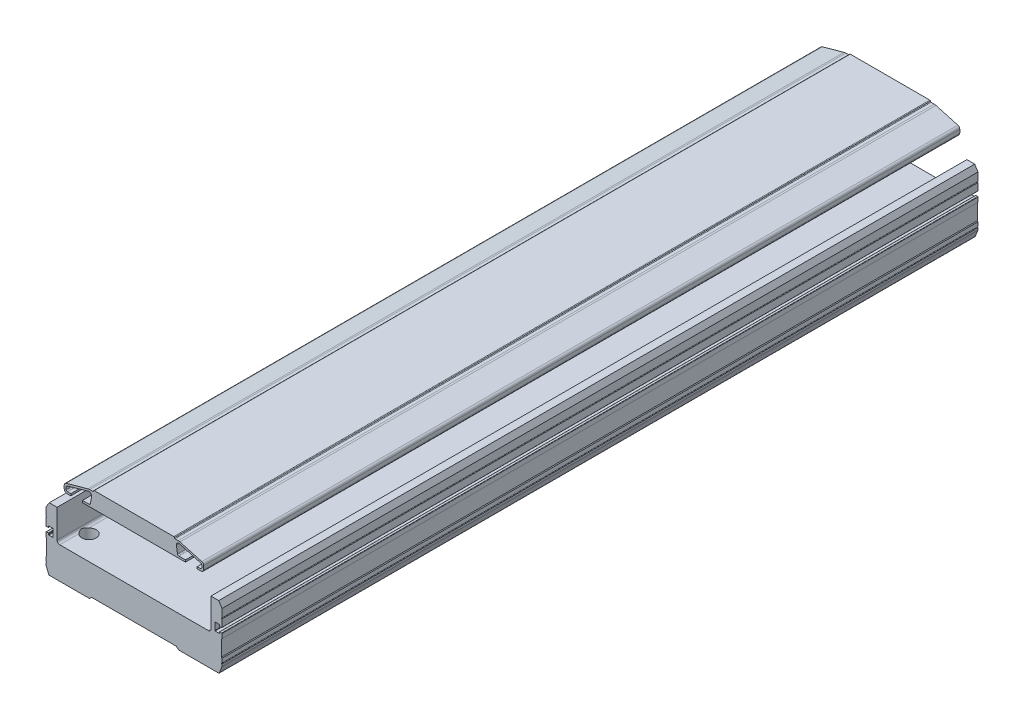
from build123d import *

# Parameters (mm, degrees)
EXTRUDE_1_DEPTH             = 580
EXTRUDE_1_2_DEPTH           = 580
HOLE_WIZARD_1_AT_2_COUNT    = 2
HOLE_WIZARD_1_AT_2_PITCH    = 100
HOLE_WIZARD_1_AT_3_COUNT    = 2
HOLE_WIZARD_1_AT_3_PITCH    = 500
HOLE_WIZARD_1_AT_4_COUNT    = 2
HOLE_WIZARD_1_AT_4_PITCH    = 300
HOLE_WIZARD_1_AT_5_COUNT    = 2
HOLE_WIZARD_1_AT_5_PITCH    = 318.176051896
HOLE_WIZARD_1_AT_6_COUNT    = 2
HOLE_WIZARD_1_AT_6_PITCH    = 511.112512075
HOLE_WIZARD_1_AT_7_COUNT    = 2
HOLE_WIZARD_1_AT_7_PITCH    = 145.725769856
HOLE_WIZARD_1_AT_8_COUNT    = 2
HOLE_WIZARD_1_AT_8_PITCH    = 106
HOLE_WIZARD_M6_1_AT_2_COUNT = 2
HOLE_WIZARD_M6_1_AT_2_PITCH = 106
HOLE_WIZARD_M6_1_AT_3_COUNT = 2
HOLE_WIZARD_M6_1_AT_3_PITCH = 100
HOLE_WIZARD_M6_1_AT_4_COUNT = 2
HOLE_WIZARD_M6_1_AT_4_PITCH = 300
HOLE_WIZARD_M6_1_AT_5_COUNT = 2
HOLE_WIZARD_M6_1_AT_5_PITCH = 500
HOLE_WIZARD_M6_1_AT_6_COUNT = 2
HOLE_WIZARD_M6_1_AT_6_PITCH = 511.112512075
HOLE_WIZARD_M6_1_AT_7_COUNT = 2
HOLE_WIZARD_M6_1_AT_7_PITCH = 318.176051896
HOLE_WIZARD_M6_1_AT_8_COUNT = 2
HOLE_WIZARD_M6_1_AT_8_PITCH = 145.725769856


with BuildPart() as part:
    # Sketch 1 → Extrude 1 (new body)
    with BuildSketch(Plane.XY):
        with BuildLine():
            Line((-51.499999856, 59.400000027), (-48.499999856, 59.400000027))
            Line((-48.499999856, 59.400000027), (-48.499999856, 60.900000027))
            Line((-48.499999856, 60.900000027), (-50.999999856, 60.900000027))
            ThreePointArc((-50.999999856, 60.900000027), (-51.707106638, 61.192893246), (-51.999999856, 61.900000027))
            Line((-51.999999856, 61.900000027), (-51.999999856, 63.704621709))
            ThreePointArc((-51.999999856, 63.704621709), (-51.796871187, 64.308770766), (-51.27000769, 64.667479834))
            Line((-51.27000769, 64.667479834), (-35.04852954, 69.21635995))
            ThreePointArc((-35.04852954, 69.21635995), (-33.17193273, 68.778444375), (-32.536146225, 66.959334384))
            Line((-32.536146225, 66.959334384), (-33.413816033, 61.73434537))
            ThreePointArc((-33.413816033, 61.73434537), (-33.754110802, 61.136568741), (-34.399999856, 60.900000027))
            Line((-34.399999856, 60.900000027), (-39.499999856, 60.900000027))
            Line((-39.499999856, 60.900000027), (-39.499999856, 59.400000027))
            Line((-39.499999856, 59.400000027), (39.500000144, 59.400000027))
            Line((39.500000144, 59.400000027), (39.500000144, 60.900000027))
            Line((39.500000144, 60.900000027), (34.400000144, 60.900000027))
            ThreePointArc((34.400000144, 60.900000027), (33.754111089, 61.136568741), (33.41381632, 61.73434537))
            Line((33.41381632, 61.73434537), (32.536146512, 66.959334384))
            ThreePointArc((32.536146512, 66.959334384), (33.171933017, 68.778444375), (35.048529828, 69.21635995))
            Line((35.048529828, 69.21635995), (51.270007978, 64.667479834))
            ThreePointArc((51.270007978, 64.667479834), (51.796871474, 64.308770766), (52.000000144, 63.704621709))
            Line((52.000000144, 63.704621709), (52.000000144, 61.900000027))
            ThreePointArc((52.000000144, 61.900000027), (51.707106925, 61.192893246), (51.000000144, 60.900000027))
            Line((51.000000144, 60.900000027), (48.500000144, 60.900000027))
            Line((48.500000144, 60.900000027), (48.500000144, 59.400000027))
            Line((48.500000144, 59.400000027), (51.500000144, 59.400000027))
            ThreePointArc((51.500000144, 59.400000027), (52.914213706, 59.985786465), (53.500000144, 61.400000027))
            Line((53.500000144, 61.400000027), (53.500000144, 64.083697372))
            ThreePointArc((53.500000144, 64.083697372), (53.093742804, 65.291995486), (52.040015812, 66.009413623))
            Line((52.040015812, 66.009413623), (35.262246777, 70.714290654))
            ThreePointArc((35.262246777, 70.714290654), (34.593583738, 70.853355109), (33.912207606, 70.900000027))
            Line((33.912207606, 70.900000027), (31.500000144, 70.900000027))
            ThreePointArc((31.500000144, 70.900000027), (31.146446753, 71.046446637), (31.000000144, 71.400000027))
            ThreePointArc((31.000000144, 71.400000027), (30.853553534, 71.753553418), (30.500000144, 71.900000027))
            Line((30.500000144, 71.900000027), (-30.499999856, 71.900000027))
            ThreePointArc((-30.499999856, 71.900000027), (-30.853553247, 71.753553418), (-30.999999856, 71.400000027))
            ThreePointArc((-30.999999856, 71.400000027), (-31.146446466, 71.046446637), (-31.499999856, 70.900000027))
            Line((-31.499999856, 70.900000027), (-33.912207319, 70.900000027))
            ThreePointArc((-33.912207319, 70.900000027), (-34.593583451, 70.853355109), (-35.262246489, 70.714290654))
            Line((-35.262246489, 70.714290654), (-52.040015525, 66.009413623))
            ThreePointArc((-52.040015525, 66.009413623), (-53.093742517, 65.291995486), (-53.499999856, 64.083697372))
            Line((-53.499999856, 64.083697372), (-53.499999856, 61.400000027))
            ThreePointArc((-53.499999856, 61.400000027), (-52.914213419, 59.985786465), (-51.499999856, 59.400000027))
        make_face()
    extrude(amount=EXTRUDE_1_DEPTH)


with BuildPart() as body_2:
    # Sketch 1 → Extrude 1 2 (new body)
    with BuildSketch(Plane.XY):
        with BuildLine():
            Line((-65.16, -1.6), (-34.1, -1.6))
            Line((-34.1, -1.6), (-32.5, 0))
            Line((-32.5, 0), (32.5, 0))
            Line((32.5, 0), (34.1, -1.6))
            Line((34.1, -1.6), (65.16, -1.6))
            ThreePointArc((65.16, -1.6), (65.35722349, -1.328991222), (65.506419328, -1.028852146))
            Line((65.506419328, -1.028852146), (67.359978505, 3.646795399))
            ThreePointArc((67.359978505, 3.646795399), (67.464610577, 4.00739535), (67.499999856, 4.381197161))
            Line((67.499999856, 4.381197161), (67.499999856, 5.625000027))
            ThreePointArc((67.499999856, 5.625000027), (67.124999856, 6.000000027), (67.499999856, 6.375000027))
            Line((67.499999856, 6.375000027), (67.499999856, 9.500000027))
            Line((67.499999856, 9.500000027), (66.999999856, 10.000000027))
            Line((66.999999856, 10.000000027), (66.999999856, 22.000000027))
            Line((66.999999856, 22.000000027), (67.499999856, 22.500000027))
            Line((67.499999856, 22.500000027), (67.499999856, 25.900000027))
            ThreePointArc((67.499999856, 25.900000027), (67.412131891, 26.112132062), (67.199999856, 26.200000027))
            Line((67.199999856, 26.200000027), (65.799999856, 26.200000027))
            ThreePointArc((65.799999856, 26.200000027), (65.587867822, 26.112132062), (65.499999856, 25.900000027))
            Line((65.499999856, 25.900000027), (65.499999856, 25.300000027))
            ThreePointArc((65.499999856, 25.300000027), (65.412131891, 25.087867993), (65.199999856, 25.000000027))
            Line((65.199999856, 25.000000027), (62.299999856, 25.000000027))
            ThreePointArc((62.299999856, 25.000000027), (62.087867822, 25.087867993), (61.999999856, 25.300000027))
            Line((61.999999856, 25.300000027), (61.999999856, 30.700000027))
            ThreePointArc((61.999999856, 30.700000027), (62.087867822, 30.912132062), (62.299999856, 31.000000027))
            Line((62.299999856, 31.000000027), (65.199999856, 31.000000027))
            ThreePointArc((65.199999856, 31.000000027), (65.412131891, 30.912132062), (65.499999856, 30.700000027))
            Line((65.499999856, 30.700000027), (65.499999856, 30.100000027))
            ThreePointArc((65.499999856, 30.100000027), (65.587867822, 29.887867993), (65.799999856, 29.800000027))
            Line((65.799999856, 29.800000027), (67.199999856, 29.800000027))
            ThreePointArc((67.199999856, 29.800000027), (67.412131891, 29.887867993), (67.499999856, 30.100000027))
            Line((67.499999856, 30.100000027), (67.499999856, 35.625000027))
            ThreePointArc((67.499999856, 35.625000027), (67.124999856, 36.000000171), (67.500000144, 36.375000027))
            Line((67.500000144, 36.375000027), (67.500000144, 42.600000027))
            Line((67.500000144, 42.600000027), (65.000000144, 46.600000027))
            Line((65.000000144, 46.600000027), (59.000000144, 46.600000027))
            Line((59.000000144, 46.600000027), (59.000000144, 24.700000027))
            ThreePointArc((59.000000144, 24.700000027), (58.414213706, 23.285786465), (57.000000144, 22.700000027))
            Line((57.000000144, 22.700000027), (-56.999999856, 22.700000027))
            ThreePointArc((-56.999999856, 22.700000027), (-58.414213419, 23.285786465), (-58.999999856, 24.700000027))
            Line((-58.999999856, 24.700000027), (-58.999999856, 46.600000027))
            Line((-58.999999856, 46.600000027), (-64.999999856, 46.600000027))
            Line((-64.999999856, 46.600000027), (-67.499999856, 42.600000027))
            Line((-67.499999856, 42.600000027), (-67.499999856, 36.375000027))
            ThreePointArc((-67.499999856, 36.375000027), (-67.124999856, 36.000000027), (-67.499999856, 35.625000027))
            Line((-67.499999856, 35.625000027), (-67.499999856, 30.100000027))
            ThreePointArc((-67.499999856, 30.100000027), (-67.412131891, 29.887867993), (-67.199999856, 29.800000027))
            Line((-67.199999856, 29.800000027), (-65.799999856, 29.800000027))
            ThreePointArc((-65.799999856, 29.800000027), (-65.587867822, 29.887867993), (-65.499999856, 30.100000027))
            Line((-65.499999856, 30.100000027), (-65.499999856, 30.700000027))
            ThreePointArc((-65.499999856, 30.700000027), (-65.412131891, 30.912132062), (-65.199999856, 31.000000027))
            Line((-65.199999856, 31.000000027), (-62.299999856, 31.000000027))
            ThreePointArc((-62.299999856, 31.000000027), (-62.087867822, 30.912132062), (-61.999999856, 30.700000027))
            Line((-61.999999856, 30.700000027), (-61.999999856, 25.300000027))
            ThreePointArc((-61.999999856, 25.300000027), (-62.087867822, 25.087867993), (-62.299999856, 25.000000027))
            Line((-62.299999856, 25.000000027), (-65.199999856, 25.000000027))
            ThreePointArc((-65.199999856, 25.000000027), (-65.412131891, 25.087867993), (-65.499999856, 25.300000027))
            Line((-65.499999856, 25.300000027), (-65.499999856, 25.900000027))
            ThreePointArc((-65.499999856, 25.900000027), (-65.587867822, 26.112132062), (-65.799999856, 26.200000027))
            Line((-65.799999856, 26.200000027), (-67.199999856, 26.200000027))
            ThreePointArc((-67.199999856, 26.200000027), (-67.412131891, 26.112132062), (-67.499999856, 25.900000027))
            Line((-67.499999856, 25.900000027), (-67.499999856, 22.500000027))
            Line((-67.499999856, 22.500000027), (-66.999999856, 22.000000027))
            Line((-66.999999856, 22.000000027), (-66.999999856, 10.000000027))
            Line((-66.999999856, 10.000000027), (-67.499999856, 9.500000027))
            Line((-67.499999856, 9.500000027), (-67.499999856, 6.375000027))
            ThreePointArc((-67.499999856, 6.375000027), (-67.124999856, 6.000000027), (-67.499999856, 5.625000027))
            Line((-67.499999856, 5.625000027), (-67.499999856, 4.381197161))
            ThreePointArc((-67.499999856, 4.381197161), (-67.464610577, 4.00739535), (-67.359978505, 3.646795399))
            Line((-67.359978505, 3.646795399), (-65.506419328, -1.028852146))
            ThreePointArc((-65.506419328, -1.028852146), (-65.35722349, -1.328991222), (-65.16, -1.6))
        make_face()
    extrude(amount=EXTRUDE_1_2_DEPTH)

    # Sketch 5 → Hole Wizard 1 (revolve, cut)
    with BuildSketch(Plane(origin=(-53, 46.600000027, 61.5), x_dir=(0, 0, 1), z_dir=(1, 0, 0))):
        Polygon((0, 0), (0, 48.200000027), (3.5, 48.200000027), (3.5, 40.9), (5.5, 40.9), (5.5, 0), align=None)
    hole_wizard_1 = revolve(axis=Axis((-53, 52.950000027, 61.5), (0, -1, 0)), mode=Mode.SUBTRACT)

    # Hole Wizard 1 at 2: Hole Wizard 1 ×2
    with Locations(*[(0, 0, i * HOLE_WIZARD_1_AT_2_PITCH) for i in range(1, HOLE_WIZARD_1_AT_2_COUNT)]):
        add(hole_wizard_1, mode=Mode.SUBTRACT)

    # Hole Wizard 1 at 3: Hole Wizard 1 ×2
    with Locations(*[(0, 0, i * HOLE_WIZARD_1_AT_3_PITCH) for i in range(1, HOLE_WIZARD_1_AT_3_COUNT)]):
        add(hole_wizard_1, mode=Mode.SUBTRACT)

    # Hole Wizard 1 at 4: Hole Wizard 1 ×2
    with Locations(*[(0, 0, i * HOLE_WIZARD_1_AT_4_PITCH) for i in range(1, HOLE_WIZARD_1_AT_4_COUNT)]):
        add(hole_wizard_1, mode=Mode.SUBTRACT)

    # Hole Wizard 1 at 5: Hole Wizard 1 ×2
    with Locations(*[Vector(0.3331488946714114, 5.701574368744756e-14, 0.9428742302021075) * (i * HOLE_WIZARD_1_AT_5_PITCH) for i in range(1, HOLE_WIZARD_1_AT_5_COUNT)]):
        add(hole_wizard_1, mode=Mode.SUBTRACT)

    # Hole Wizard 1 at 6: Hole Wizard 1 ×2
    with Locations(*[Vector(0.20739073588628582, 3.5493250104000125e-14, 0.9782581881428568) * (i * HOLE_WIZARD_1_AT_6_PITCH) for i in range(1, HOLE_WIZARD_1_AT_6_COUNT)]):
        add(hole_wizard_1, mode=Mode.SUBTRACT)

    # Hole Wizard 1 at 7: Hole Wizard 1 ×2
    with Locations(*[Vector(0.7273936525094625, 1.2448755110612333e-13, 0.6862204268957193) * (i * HOLE_WIZARD_1_AT_7_PITCH) for i in range(1, HOLE_WIZARD_1_AT_7_COUNT)]):
        add(hole_wizard_1, mode=Mode.SUBTRACT)

    # Hole Wizard 1 at 8: Hole Wizard 1 ×2
    with Locations(*[(i * HOLE_WIZARD_1_AT_8_PITCH, 0, 0) for i in range(1, HOLE_WIZARD_1_AT_8_COUNT)]):
        add(hole_wizard_1, mode=Mode.SUBTRACT)

    # Sketch 9 → Hole Wizard M6 _1 (revolve, cut)
    with BuildSketch(Plane(origin=(53, -1.6, 51.5), x_dir=(0, 0, -1), z_dir=(1, 0, 0))):
        Polygon((0, 0), (0, 12.502151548), (2.5, 11), (2.5, 0), align=None)
    hole_wizard_m6_1 = revolve(axis=Axis((53, -7.95, 51.5), (0, 1, 0)), mode=Mode.SUBTRACT)

    # Hole Wizard M6 _1 at 2: Hole Wizard M6 _1 ×2
    with Locations(*[(-i * HOLE_WIZARD_M6_1_AT_2_PITCH, 0, 0) for i in range(1, HOLE_WIZARD_M6_1_AT_2_COUNT)]):
        add(hole_wizard_m6_1, mode=Mode.SUBTRACT)

    # Hole Wizard M6 _1 at 3: Hole Wizard M6 _1 ×2
    with Locations(*[(0, 0, i * HOLE_WIZARD_M6_1_AT_3_PITCH) for i in range(1, HOLE_WIZARD_M6_1_AT_3_COUNT)]):
        add(hole_wizard_m6_1, mode=Mode.SUBTRACT)

    # Hole Wizard M6 _1 at 4: Hole Wizard M6 _1 ×2
    with Locations(*[(0, 0, i * HOLE_WIZARD_M6_1_AT_4_PITCH) for i in range(1, HOLE_WIZARD_M6_1_AT_4_COUNT)]):
        add(hole_wizard_m6_1, mode=Mode.SUBTRACT)

    # Hole Wizard M6 _1 at 5: Hole Wizard M6 _1 ×2
    with Locations(*[(0, 0, i * HOLE_WIZARD_M6_1_AT_5_PITCH) for i in range(1, HOLE_WIZARD_M6_1_AT_5_COUNT)]):
        add(hole_wizard_m6_1, mode=Mode.SUBTRACT)

    # Hole Wizard M6 _1 at 6: Hole Wizard M6 _1 ×2
    with Locations(*[Vector(-0.20739073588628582, 0, 0.9782581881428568) * (i * HOLE_WIZARD_M6_1_AT_6_PITCH) for i in range(1, HOLE_WIZARD_M6_1_AT_6_COUNT)]):
        add(hole_wizard_m6_1, mode=Mode.SUBTRACT)

    # Hole Wizard M6 _1 at 7: Hole Wizard M6 _1 ×2
    with Locations(*[Vector(-0.33314889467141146, 0, 0.9428742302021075) * (i * HOLE_WIZARD_M6_1_AT_7_PITCH) for i in range(1, HOLE_WIZARD_M6_1_AT_7_COUNT)]):
        add(hole_wizard_m6_1, mode=Mode.SUBTRACT)

    # Hole Wizard M6 _1 at 8: Hole Wizard M6 _1 ×2
    with Locations(*[Vector(-0.7273936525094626, 0, 0.6862204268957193) * (i * HOLE_WIZARD_M6_1_AT_8_PITCH) for i in range(1, HOLE_WIZARD_M6_1_AT_8_COUNT)]):
        add(hole_wizard_m6_1, mode=Mode.SUBTRACT)


solid = Compound([part.part, body_2.part])
